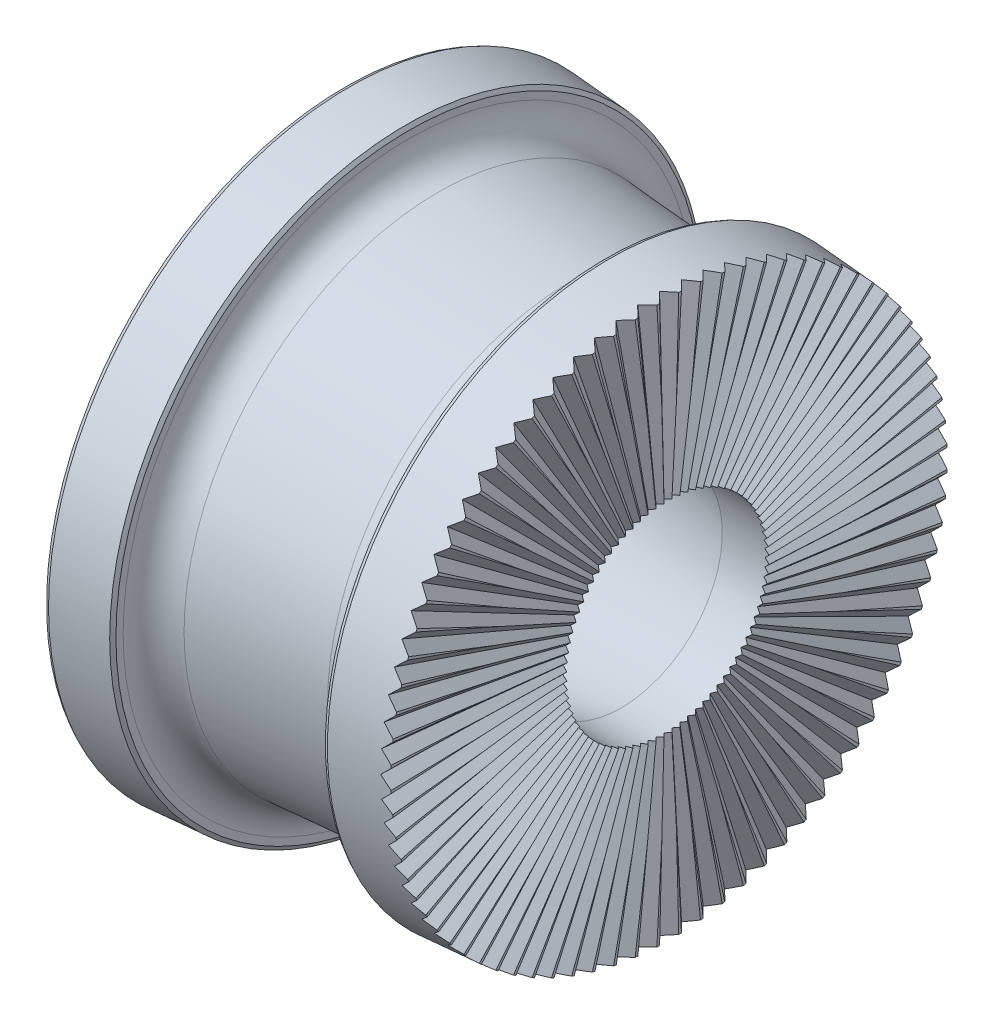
from build123d import *
from OCP.BRepFilletAPI import BRepFilletAPI_MakeChamfer

# Parameters (mm, degrees)
CUT_EXTRUDE1_DEPTH = 12
CUT_EXTRUDE1_TAPER = -1
CIRPATTERN1_COUNT  = 80
CHAMFER1_SIZE      = 0.15
CHAMFER1_SIZE2     = 0.097905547
CHAMFER1_SIZE2_2   = 0.083429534
CHAMFER1_SIZE2_3   = 0.090489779


with BuildPart() as part:
    # Sketch1 → Revolve1 (revolve)
    with BuildSketch(Plane.XY, mode=Mode.PRIVATE) as revolve1_sk:
        with BuildLine():
            Line((10.9, 4), (12.8, 4))
            Line((12.8, 4), (12.8, 11))
            Line((12.8, 11), (10.3, 11.17578125))
            Line((10.3, 11.17578125), (10.3, 10.91675797))
            ThreePointArc((10.3, 10.91675797), (9.9023225, 10.002402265), (8.962325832, 9.669836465))
            Line((8.962325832, 9.669836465), (3.662325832, 10.042492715))
            ThreePointArc((3.662325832, 10.042492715), (2.835644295, 10.43709172), (2.5, 11.28941422))
            Line((2.5, 11.28941422), (2.5, 11.72421875))
            Line((2.5, 11.72421875), (0, 11.9))
            Line((0, 11.9), (0, 5.92196409))
            Line((0, 5.92196409), (10.9, 4))
        make_face()
    revolve(revolve1_sk.sketch.rotate(Axis((0, 0, 0), (1, 0, 0)), 90), axis=Axis((0, 0, 0), (1, 0, 0)))

    # Sketch2 → Cut-Extrude1 (cut)
    with BuildSketch(Plane.XY):
        Polygon((12.692933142, 0), (12.898905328, -0.205972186), (12.898905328, 0), (12.898905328, 0.205972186), align=None)
    cut_extrude1 = extrude(amount=-CUT_EXTRUDE1_DEPTH, taper=CUT_EXTRUDE1_TAPER, mode=Mode.SUBTRACT)

    # CirPattern1: Cut-Extrude1 ×80 about axis
    cirpattern1_axis = Axis((0, 0, 0), (1, 0, 0))
    for i in range(1, CIRPATTERN1_COUNT):
        add(cut_extrude1.rotate(cirpattern1_axis, i * 360 / CIRPATTERN1_COUNT), mode=Mode.SUBTRACT)

    # Chamfer1: one chamfer whose edges measure the first distance from different faces: ONE call of the kernel's chamfer builder (chamfer() names one face for all edges)
    chamfer1_edges_1 = [part.edges().sort_by_distance(p)[0] for p in [
        (0, 0, -5.92196409),
    ]]
    chamfer1_side_1 = [part.faces().sort_by_distance(p)[0] for p in [
        (0, 0, -11.563417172),
    ]]
    chamfer1_edges_2 = [part.edges().sort_by_distance(p)[0] for p in [
        (0, 0, -11.9),
    ]]
    chamfer1_side_2 = [part.faces().sort_by_distance(p)[0] for p in [
        (1.25, 0, -11.812109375),
    ]]
    chamfer1_edges_3 = [part.edges().sort_by_distance(p)[0] for p in [
        (2.5, 0, -11.72421875),
    ]]
    chamfer1_side_3 = [part.faces().sort_by_distance(p)[0] for p in [
        (2.5, 0, -11.621025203),
    ]]
    chamfer1_edges_4 = [part.edges().sort_by_distance(p)[0] for p in [
        (10.3, 0, -11.17578125),
    ]]
    chamfer1_side_4 = [part.faces().sort_by_distance(p)[0] for p in [
        (11.55, 0, -11.087890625),
    ]]
    chamfer1 = BRepFilletAPI_MakeChamfer(part.part.solid().wrapped)
    for e in chamfer1_edges_1:
        chamfer1.Add(CHAMFER1_SIZE, CHAMFER1_SIZE2, e.wrapped, chamfer1_side_1[0].wrapped)  # the first distance lies on this face
    for e in chamfer1_edges_2:
        chamfer1.Add(CHAMFER1_SIZE, CHAMFER1_SIZE2_2, e.wrapped, chamfer1_side_2[0].wrapped)  # the first distance lies on this face
    for e in chamfer1_edges_3:
        chamfer1.Add(CHAMFER1_SIZE, CHAMFER1_SIZE2_3, e.wrapped, chamfer1_side_3[0].wrapped)  # the first distance lies on this face
    for e in chamfer1_edges_4:
        chamfer1.Add(CHAMFER1_SIZE, CHAMFER1_SIZE2_2, e.wrapped, chamfer1_side_4[0].wrapped)  # the first distance lies on this face
    add(Compound.cast(chamfer1.Shape()), mode=Mode.REPLACE)


solid = part.part
